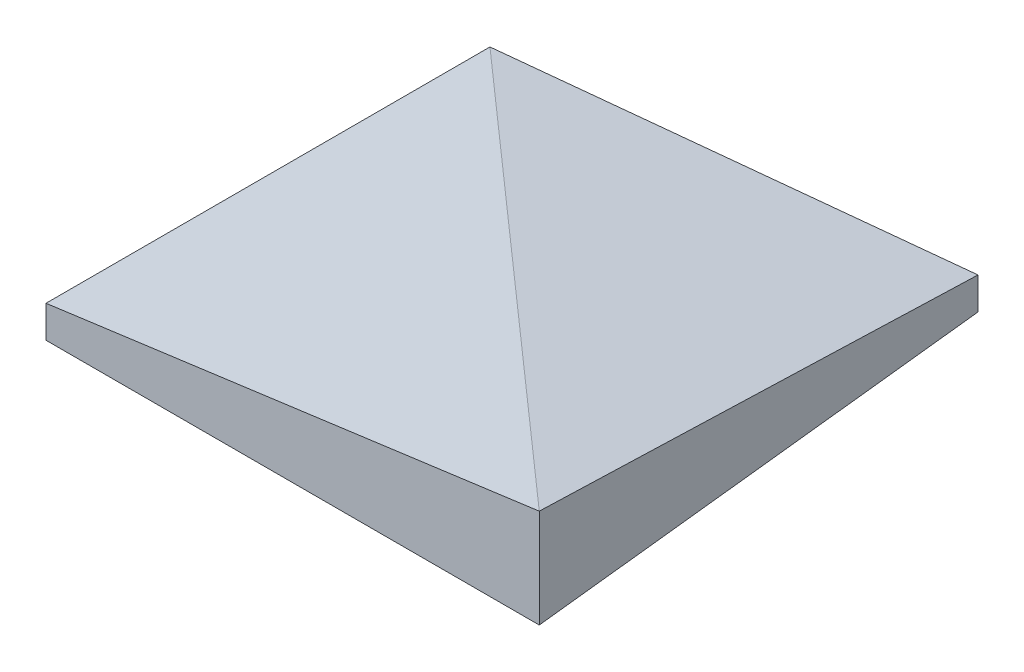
from build123d import *

# Parameters (mm, degrees)
BOSS_EXTRUDE1_DEPTH     = 400
CUT_EXTRUDE1_DEPTH      = 2098.61769634
CUT_EXTRUDE1_DEPTH_BACK = 2098.61769634


with BuildPart() as part:
    # Sketch1 → Boss-Extrude1 (new body)
    with BuildSketch(Plane(origin=(0, 0, 0), x_dir=(1, 0, 0), z_dir=(0, 1, 0))):
        Polygon((-1000, 900), (-1000, -900), (1000, -900), align=None)
    extrude(amount=BOSS_EXTRUDE1_DEPTH)

    # Sketch2 → Cut-Extrude1 (cut, two sides: drawn at the far end of the back side and taken through both)
    with BuildSketch(Plane.XY.offset(900).offset(-CUT_EXTRUDE1_DEPTH_BACK)):
        Polygon((5052.454357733, 947.081338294), (1000, 400), (-1000, 130), (-5052.454357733, -417.081338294), (-6146.617034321, 7687.827377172), (3958.291681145, 9051.99005376), align=None)
    extrude(amount=CUT_EXTRUDE1_DEPTH + CUT_EXTRUDE1_DEPTH_BACK, mode=Mode.SUBTRACT)

    # Mirror1: part across plane


with BuildPart() as part_1:
    add(part.part)
    add(part.part.mirror(Plane(origin=(0, 400, 0), x_dir=(0.7432941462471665, 0, 0.6689647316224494), z_dir=(0.6689647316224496, 0, -0.7432941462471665))))


solid = part_1.part
